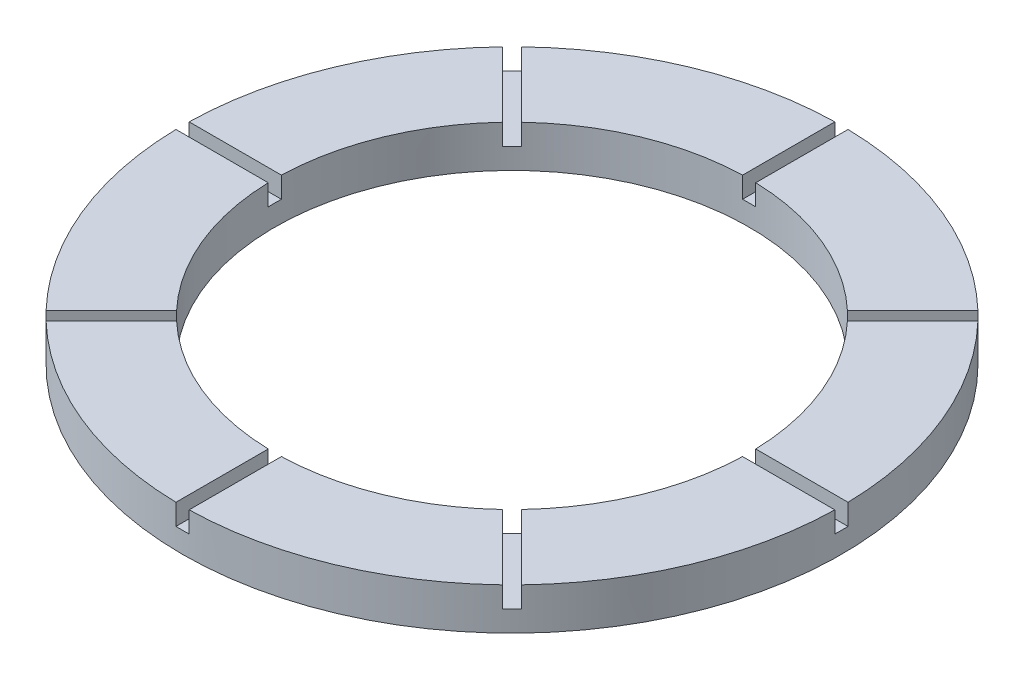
ISO-10303-21;
HEADER;
FILE_DESCRIPTION(('STEP AP214'),'2;1');
FILE_NAME('part.step','',(''),(''),'','','');
FILE_SCHEMA(('AUTOMOTIVE_DESIGN { 1 0 10303 214 1 1 1 1 }'));
ENDSEC;
DATA;
#1=APPLICATION_CONTEXT('core data for automotive mechanical design processes');
#2=APPLICATION_PROTOCOL_DEFINITION('international standard','automotive_design',2000,#1);
#3=PRODUCT_CONTEXT('',#1,'mechanical');
#4=PRODUCT('Part','Part','',(#3));
#5=PRODUCT_RELATED_PRODUCT_CATEGORY('part','',(#4));
#6=PRODUCT_DEFINITION_FORMATION('','',#4);
#7=PRODUCT_DEFINITION_CONTEXT('part definition',#1,'design');
#8=PRODUCT_DEFINITION('design','',#6,#7);
#9=PRODUCT_DEFINITION_SHAPE('','',#8);
#10=(LENGTH_UNIT() NAMED_UNIT(*) SI_UNIT(.MILLI.,.METRE.));
#11=(NAMED_UNIT(*) PLANE_ANGLE_UNIT() SI_UNIT($,.RADIAN.));
#12=(NAMED_UNIT(*) SI_UNIT($,.STERADIAN.) SOLID_ANGLE_UNIT());
#13=UNCERTAINTY_MEASURE_WITH_UNIT(LENGTH_MEASURE(1.E-05),#10,'distance_accuracy_value','');
#14=(GEOMETRIC_REPRESENTATION_CONTEXT(3) GLOBAL_UNCERTAINTY_ASSIGNED_CONTEXT((#13)) GLOBAL_UNIT_ASSIGNED_CONTEXT((#10,
#11,#12)) REPRESENTATION_CONTEXT('',''));
#15=CARTESIAN_POINT('',(0.,0.,0.));
#16=DIRECTION('',(0.,0.,1.));
#17=DIRECTION('',(1.,0.,0.));
#18=AXIS2_PLACEMENT_3D('',#15,#16,#17);
#19=CARTESIAN_POINT('',(0.,3.175,0.));
#20=DIRECTION('',(0.,1.,0.));
#21=DIRECTION('',(0.,0.,1.));
#22=AXIS2_PLACEMENT_3D('',#19,#20,#21);
#23=PLANE('',#22);
#24=CARTESIAN_POINT('',(0.,3.175,0.));
#25=DIRECTION('',(0.,1.,0.));
#26=DIRECTION('',(0.,0.,1.));
#27=AXIS2_PLACEMENT_3D('',#24,#25,#26);
#28=CIRCLE('',#27,36.);
#29=CARTESIAN_POINT('',(-1.,3.175,-35.9861084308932));
#30=VERTEX_POINT('',#29);
#31=CARTESIAN_POINT('',(-24.7389145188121,3.175,-26.1531280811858));
#32=VERTEX_POINT('',#31);
#33=EDGE_CURVE('E473',#30,#32,#28,.T.);
#34=ORIENTED_EDGE('',*,*,#33,.F.);
#35=DIRECTION('',(0.,0.,-1.));
#36=VECTOR('',#35,1.);
#37=CARTESIAN_POINT('',(-1.,3.175,0.));
#38=LINE('',#37,#36);
#39=CARTESIAN_POINT('',(-1.,3.175,-49.9899989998));
#40=VERTEX_POINT('',#39);
#41=EDGE_CURVE('E385',#30,#40,#38,.T.);
#42=ORIENTED_EDGE('',*,*,#41,.T.);
#43=CARTESIAN_POINT('',(0.,3.175,0.));
#44=DIRECTION('',(0.,1.,0.));
#45=DIRECTION('',(0.,0.,1.));
#46=AXIS2_PLACEMENT_3D('',#43,#44,#45);
#47=CIRCLE('',#46,50.);
#48=CARTESIAN_POINT('',(-34.6411605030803,3.175,-36.0553740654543));
#49=VERTEX_POINT('',#48);
#50=EDGE_CURVE('E471',#40,#49,#47,.T.);
#51=ORIENTED_EDGE('',*,*,#50,.T.);
#52=DIRECTION('',(-0.707106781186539,0.,-0.707106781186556));
#53=VECTOR('',#52,1.);
#54=CARTESIAN_POINT('',(0.707106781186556,3.175,-0.707106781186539));
#55=LINE('',#54,#53);
#56=EDGE_CURVE('E371',#32,#49,#55,.T.);
#57=ORIENTED_EDGE('',*,*,#56,.F.);
#58=EDGE_LOOP('',(#34,#42,#51,#57));
#59=FACE_BOUND('',#58,.T.);
#60=ADVANCED_FACE('F34',(#59),#23,.T.);
#61=CARTESIAN_POINT('',(0.999999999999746,3.175,35.9861084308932));
#62=VERTEX_POINT('',#61);
#63=CARTESIAN_POINT('',(24.7389145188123,3.175,26.1531280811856));
#64=VERTEX_POINT('',#63);
#65=EDGE_CURVE('E453',#62,#64,#28,.T.);
#66=ORIENTED_EDGE('',*,*,#65,.F.);
#67=DIRECTION('',(0.,0.,1.));
#68=VECTOR('',#67,1.);
#69=CARTESIAN_POINT('',(1.,3.175,0.));
#70=LINE('',#69,#68);
#71=CARTESIAN_POINT('',(0.999999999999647,3.175,49.9899989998));
#72=VERTEX_POINT('',#71);
#73=EDGE_CURVE('E345',#62,#72,#70,.T.);
#74=ORIENTED_EDGE('',*,*,#73,.T.);
#75=CARTESIAN_POINT('',(34.6411605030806,3.175,36.055374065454));
#76=VERTEX_POINT('',#75);
#77=EDGE_CURVE('E448',#72,#76,#47,.T.);
#78=ORIENTED_EDGE('',*,*,#77,.T.);
#79=DIRECTION('',(0.707106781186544,0.,0.707106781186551));
#80=VECTOR('',#79,1.);
#81=CARTESIAN_POINT('',(-0.707106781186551,3.175,0.707106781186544));
#82=LINE('',#81,#80);
#83=EDGE_CURVE('E331',#64,#76,#82,.T.);
#84=ORIENTED_EDGE('',*,*,#83,.F.);
#85=EDGE_LOOP('',(#66,#74,#78,#84));
#86=FACE_BOUND('',#85,.T.);
#87=ADVANCED_FACE('F550',(#86),#23,.T.);
#88=DIRECTION('',(0.,0.,1.));
#89=VECTOR('',#88,1.);
#90=CARTESIAN_POINT('',(-1.,3.175,0.));
#91=LINE('',#90,#89);
#92=CARTESIAN_POINT('',(-1.00000000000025,3.175,35.9861084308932));
#93=VERTEX_POINT('',#92);
#94=CARTESIAN_POINT('',(-1.00000000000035,3.175,49.9899989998));
#95=VERTEX_POINT('',#94);
#96=EDGE_CURVE('E342',#93,#95,#91,.T.);
#97=ORIENTED_EDGE('',*,*,#96,.F.);
#98=CARTESIAN_POINT('',(-24.7389145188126,3.175,26.1531280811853));
#99=VERTEX_POINT('',#98);
#100=EDGE_CURVE('E460',#99,#93,#28,.T.);
#101=ORIENTED_EDGE('',*,*,#100,.F.);
#102=DIRECTION('',(-0.707106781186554,0.,0.707106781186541));
#103=VECTOR('',#102,1.);
#104=CARTESIAN_POINT('',(0.707106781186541,3.175,0.707106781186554));
#105=LINE('',#104,#103);
#106=CARTESIAN_POINT('',(-34.6411605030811,3.175,36.0553740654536));
#107=VERTEX_POINT('',#106);
#108=EDGE_CURVE('E352',#99,#107,#105,.T.);
#109=ORIENTED_EDGE('',*,*,#108,.T.);
#110=EDGE_CURVE('E452',#107,#95,#47,.T.);
#111=ORIENTED_EDGE('',*,*,#110,.T.);
#112=EDGE_LOOP('',(#97,#101,#109,#111));
#113=FACE_BOUND('',#112,.T.);
#114=ADVANCED_FACE('F491',(#113),#23,.T.);
#115=CARTESIAN_POINT('',(26.1531280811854,3.175,24.7389145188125));
#116=VERTEX_POINT('',#115);
#117=CARTESIAN_POINT('',(35.9861084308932,3.175,1.00000000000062));
#118=VERTEX_POINT('',#117);
#119=EDGE_CURVE('E463',#116,#118,#28,.T.);
#120=ORIENTED_EDGE('',*,*,#119,.F.);
#121=DIRECTION('',(0.707106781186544,0.,0.707106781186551));
#122=VECTOR('',#121,1.);
#123=CARTESIAN_POINT('',(0.707106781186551,3.175,-0.707106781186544));
#124=LINE('',#123,#122);
#125=CARTESIAN_POINT('',(36.0553740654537,3.175,34.6411605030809));
#126=VERTEX_POINT('',#125);
#127=EDGE_CURVE('E334',#116,#126,#124,.T.);
#128=ORIENTED_EDGE('',*,*,#127,.T.);
#129=CARTESIAN_POINT('',(49.9899989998,3.175,1.00000000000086));
#130=VERTEX_POINT('',#129);
#131=EDGE_CURVE('E456',#126,#130,#47,.T.);
#132=ORIENTED_EDGE('',*,*,#131,.T.);
#133=DIRECTION('',(1.,0.,0.));
#134=VECTOR('',#133,1.);
#135=CARTESIAN_POINT('',(0.,3.175,1.));
#136=LINE('',#135,#134);
#137=EDGE_CURVE('E321',#118,#130,#136,.T.);
#138=ORIENTED_EDGE('',*,*,#137,.F.);
#139=EDGE_LOOP('',(#120,#128,#132,#138));
#140=FACE_BOUND('',#139,.T.);
#141=ADVANCED_FACE('F524',(#140),#23,.T.);
#142=DIRECTION('',(-0.707106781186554,0.,0.707106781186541));
#143=VECTOR('',#142,1.);
#144=CARTESIAN_POINT('',(-0.707106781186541,3.175,-0.707106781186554));
#145=LINE('',#144,#143);
#146=CARTESIAN_POINT('',(-26.1531280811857,3.175,24.7389145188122));
#147=VERTEX_POINT('',#146);
#148=CARTESIAN_POINT('',(-36.0553740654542,3.175,34.6411605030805));
#149=VERTEX_POINT('',#148);
#150=EDGE_CURVE('E350',#147,#149,#145,.T.);
#151=ORIENTED_EDGE('',*,*,#150,.F.);
#152=CARTESIAN_POINT('',(-35.9861084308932,3.175,0.999999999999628));
#153=VERTEX_POINT('',#152);
#154=EDGE_CURVE('E505',#153,#147,#28,.T.);
#155=ORIENTED_EDGE('',*,*,#154,.F.);
#156=DIRECTION('',(-1.,0.,0.));
#157=VECTOR('',#156,1.);
#158=CARTESIAN_POINT('',(0.,3.175,1.));
#159=LINE('',#158,#157);
#160=CARTESIAN_POINT('',(-49.9899989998,3.175,0.999999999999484));
#161=VERTEX_POINT('',#160);
#162=EDGE_CURVE('E363',#153,#161,#159,.T.);
#163=ORIENTED_EDGE('',*,*,#162,.T.);
#164=EDGE_CURVE('E479',#161,#149,#47,.T.);
#165=ORIENTED_EDGE('',*,*,#164,.T.);
#166=EDGE_LOOP('',(#151,#155,#163,#165));
#167=FACE_BOUND('',#166,.T.);
#168=ADVANCED_FACE('F541',(#167),#23,.T.);
#169=CARTESIAN_POINT('',(35.9861084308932,3.175,-0.99999999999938));
#170=VERTEX_POINT('',#169);
#171=CARTESIAN_POINT('',(26.1531280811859,3.175,-24.738914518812));
#172=VERTEX_POINT('',#171);
#173=EDGE_CURVE('E514',#170,#172,#28,.T.);
#174=ORIENTED_EDGE('',*,*,#173,.F.);
#175=DIRECTION('',(1.,0.,0.));
#176=VECTOR('',#175,1.);
#177=CARTESIAN_POINT('',(0.,3.175,-1.));
#178=LINE('',#177,#176);
#179=CARTESIAN_POINT('',(49.9899989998,3.175,-0.999999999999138));
#180=VERTEX_POINT('',#179);
#181=EDGE_CURVE('E323',#170,#180,#178,.T.);
#182=ORIENTED_EDGE('',*,*,#181,.T.);
#183=CARTESIAN_POINT('',(36.0553740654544,3.175,-34.6411605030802));
#184=VERTEX_POINT('',#183);
#185=EDGE_CURVE('E477',#180,#184,#47,.T.);
#186=ORIENTED_EDGE('',*,*,#185,.T.);
#187=DIRECTION('',(0.707106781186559,0.,-0.707106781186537));
#188=VECTOR('',#187,1.);
#189=CARTESIAN_POINT('',(0.707106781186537,3.175,0.707106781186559));
#190=LINE('',#189,#188);
#191=EDGE_CURVE('E248',#172,#184,#190,.T.);
#192=ORIENTED_EDGE('',*,*,#191,.F.);
#193=EDGE_LOOP('',(#174,#182,#186,#192));
#194=FACE_BOUND('',#193,.T.);
#195=ADVANCED_FACE('F538',(#194),#23,.T.);
#196=DIRECTION('',(-1.,0.,0.));
#197=VECTOR('',#196,1.);
#198=CARTESIAN_POINT('',(0.,3.175,-1.));
#199=LINE('',#198,#197);
#200=CARTESIAN_POINT('',(-35.9861084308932,3.175,-1.00000000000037));
#201=VERTEX_POINT('',#200);
#202=CARTESIAN_POINT('',(-49.9899989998,3.175,-1.00000000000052));
#203=VERTEX_POINT('',#202);
#204=EDGE_CURVE('E360',#201,#203,#199,.T.);
#205=ORIENTED_EDGE('',*,*,#204,.F.);
#206=CARTESIAN_POINT('',(-26.1531280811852,3.175,-24.7389145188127));
#207=VERTEX_POINT('',#206);
#208=EDGE_CURVE('E507',#207,#201,#28,.T.);
#209=ORIENTED_EDGE('',*,*,#208,.F.);
#210=DIRECTION('',(-0.707106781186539,0.,-0.707106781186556));
#211=VECTOR('',#210,1.);
#212=CARTESIAN_POINT('',(-0.707106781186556,3.175,0.707106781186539));
#213=LINE('',#212,#211);
#214=CARTESIAN_POINT('',(-36.0553740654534,3.175,-34.6411605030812));
#215=VERTEX_POINT('',#214);
#216=EDGE_CURVE('E374',#207,#215,#213,.T.);
#217=ORIENTED_EDGE('',*,*,#216,.T.);
#218=EDGE_CURVE('E475',#215,#203,#47,.T.);
#219=ORIENTED_EDGE('',*,*,#218,.T.);
#220=EDGE_LOOP('',(#205,#209,#217,#219));
#221=FACE_BOUND('',#220,.T.);
#222=ADVANCED_FACE('F540',(#221),#23,.T.);
#223=DIRECTION('',(0.,0.,-1.));
#224=VECTOR('',#223,1.);
#225=CARTESIAN_POINT('',(1.,3.175,0.));
#226=LINE('',#225,#224);
#227=CARTESIAN_POINT('',(1.,3.175,-35.9861084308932));
#228=VERTEX_POINT('',#227);
#229=CARTESIAN_POINT('',(1.,3.175,-49.9899989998));
#230=VERTEX_POINT('',#229);
#231=EDGE_CURVE('E382',#228,#230,#226,.T.);
#232=ORIENTED_EDGE('',*,*,#231,.F.);
#233=CARTESIAN_POINT('',(24.7389145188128,3.175,-26.1531280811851));
#234=VERTEX_POINT('',#233);
#235=EDGE_CURVE('E405',#234,#228,#28,.T.);
#236=ORIENTED_EDGE('',*,*,#235,.F.);
#237=DIRECTION('',(0.707106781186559,0.,-0.707106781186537));
#238=VECTOR('',#237,1.);
#239=CARTESIAN_POINT('',(-0.707106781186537,3.175,-0.707106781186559));
#240=LINE('',#239,#238);
#241=CARTESIAN_POINT('',(34.6411605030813,3.175,-36.0553740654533));
#242=VERTEX_POINT('',#241);
#243=EDGE_CURVE('E264',#234,#242,#240,.T.);
#244=ORIENTED_EDGE('',*,*,#243,.T.);
#245=EDGE_CURVE('E474',#242,#230,#47,.T.);
#246=ORIENTED_EDGE('',*,*,#245,.T.);
#247=EDGE_LOOP('',(#232,#236,#244,#246));
#248=FACE_BOUND('',#247,.T.);
#249=ADVANCED_FACE('F547',(#248),#23,.T.);
#250=CARTESIAN_POINT('',(0.,3.175,0.));
#251=DIRECTION('',(0.,-1.,0.));
#252=DIRECTION('',(0.,0.,-1.));
#253=AXIS2_PLACEMENT_3D('',#250,#251,#252);
#254=CYLINDRICAL_SURFACE('',#253,50.);
#255=CARTESIAN_POINT('',(0.,-3.175,0.));
#256=DIRECTION('',(0.,1.,0.));
#257=DIRECTION('',(0.,0.,1.));
#258=AXIS2_PLACEMENT_3D('',#255,#256,#257);
#259=CIRCLE('',#258,50.);
#260=CARTESIAN_POINT('',(0.,-3.175,50.));
#261=VERTEX_POINT('',#260);
#262=EDGE_CURVE('E449',#261,#261,#259,.T.);
#263=ORIENTED_EDGE('',*,*,#262,.T.);
#264=EDGE_LOOP('',(#263));
#265=FACE_BOUND('',#264,.T.);
#266=DIRECTION('',(0.,-1.,0.));
#267=VECTOR('',#266,1.);
#268=CARTESIAN_POINT('',(-1.,3.175,-49.9899989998));
#269=LINE('',#268,#267);
#270=CARTESIAN_POINT('',(-1.,0.,-49.9899989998));
#271=VERTEX_POINT('',#270);
#272=EDGE_CURVE('E274',#271,#40,#269,.F.);
#273=ORIENTED_EDGE('',*,*,#272,.F.);
#274=CARTESIAN_POINT('',(0.,0.,0.));
#275=DIRECTION('',(0.,-1.,0.));
#276=DIRECTION('',(0.,0.,-1.));
#277=AXIS2_PLACEMENT_3D('',#274,#275,#276);
#278=CIRCLE('',#277,50.);
#279=CARTESIAN_POINT('',(1.,0.,-49.9899989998));
#280=VERTEX_POINT('',#279);
#281=EDGE_CURVE('E272',#271,#280,#278,.T.);
#282=ORIENTED_EDGE('',*,*,#281,.T.);
#283=DIRECTION('',(0.,-1.,0.));
#284=VECTOR('',#283,1.);
#285=CARTESIAN_POINT('',(1.,3.175,-49.9899989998));
#286=LINE('',#285,#284);
#287=EDGE_CURVE('E269',#280,#230,#286,.F.);
#288=ORIENTED_EDGE('',*,*,#287,.T.);
#289=ORIENTED_EDGE('',*,*,#245,.F.);
#290=DIRECTION('',(0.,-1.,0.));
#291=VECTOR('',#290,1.);
#292=CARTESIAN_POINT('',(34.6411605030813,3.175,-36.0553740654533));
#293=LINE('',#292,#291);
#294=CARTESIAN_POINT('',(34.6411605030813,0.,-36.0553740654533));
#295=VERTEX_POINT('',#294);
#296=EDGE_CURVE('E253',#295,#242,#293,.F.);
#297=ORIENTED_EDGE('',*,*,#296,.F.);
#298=CARTESIAN_POINT('',(36.0553740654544,0.,-34.6411605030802));
#299=VERTEX_POINT('',#298);
#300=EDGE_CURVE('E258',#295,#299,#278,.T.);
#301=ORIENTED_EDGE('',*,*,#300,.T.);
#302=DIRECTION('',(0.,-1.,0.));
#303=VECTOR('',#302,1.);
#304=CARTESIAN_POINT('',(36.0553740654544,3.175,-34.6411605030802));
#305=LINE('',#304,#303);
#306=EDGE_CURVE('E242',#299,#184,#305,.F.);
#307=ORIENTED_EDGE('',*,*,#306,.T.);
#308=ORIENTED_EDGE('',*,*,#185,.F.);
#309=DIRECTION('',(0.,-1.,0.));
#310=VECTOR('',#309,1.);
#311=CARTESIAN_POINT('',(49.9899989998,3.175,-0.999999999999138));
#312=LINE('',#311,#310);
#313=CARTESIAN_POINT('',(49.9899989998,0.,-0.999999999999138));
#314=VERTEX_POINT('',#313);
#315=EDGE_CURVE('E304',#314,#180,#312,.F.);
#316=ORIENTED_EDGE('',*,*,#315,.F.);
#317=CARTESIAN_POINT('',(49.9899989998,0.,1.00000000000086));
#318=VERTEX_POINT('',#317);
#319=EDGE_CURVE('E270',#314,#318,#278,.T.);
#320=ORIENTED_EDGE('',*,*,#319,.T.);
#321=DIRECTION('',(0.,-1.,0.));
#322=VECTOR('',#321,1.);
#323=CARTESIAN_POINT('',(49.9899989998,3.175,1.00000000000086));
#324=LINE('',#323,#322);
#325=EDGE_CURVE('E306',#318,#130,#324,.F.);
#326=ORIENTED_EDGE('',*,*,#325,.T.);
#327=ORIENTED_EDGE('',*,*,#131,.F.);
#328=DIRECTION('',(0.,-1.,0.));
#329=VECTOR('',#328,1.);
#330=CARTESIAN_POINT('',(36.0553740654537,3.175,34.6411605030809));
#331=LINE('',#330,#329);
#332=CARTESIAN_POINT('',(36.0553740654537,0.,34.6411605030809));
#333=VERTEX_POINT('',#332);
#334=EDGE_CURVE('E297',#333,#126,#331,.F.);
#335=ORIENTED_EDGE('',*,*,#334,.F.);
#336=CARTESIAN_POINT('',(34.6411605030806,0.,36.055374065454));
#337=VERTEX_POINT('',#336);
#338=EDGE_CURVE('E277',#333,#337,#278,.T.);
#339=ORIENTED_EDGE('',*,*,#338,.T.);
#340=DIRECTION('',(0.,-1.,0.));
#341=VECTOR('',#340,1.);
#342=CARTESIAN_POINT('',(34.6411605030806,3.175,36.055374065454));
#343=LINE('',#342,#341);
#344=EDGE_CURVE('E299',#337,#76,#343,.F.);
#345=ORIENTED_EDGE('',*,*,#344,.T.);
#346=ORIENTED_EDGE('',*,*,#77,.F.);
#347=DIRECTION('',(0.,-1.,0.));
#348=VECTOR('',#347,1.);
#349=CARTESIAN_POINT('',(0.999999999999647,3.175,49.9899989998));
#350=LINE('',#349,#348);
#351=CARTESIAN_POINT('',(0.999999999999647,0.,49.9899989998));
#352=VERTEX_POINT('',#351);
#353=EDGE_CURVE('E281',#352,#72,#350,.F.);
#354=ORIENTED_EDGE('',*,*,#353,.F.);
#355=CARTESIAN_POINT('',(-1.00000000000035,0.,49.9899989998));
#356=VERTEX_POINT('',#355);
#357=EDGE_CURVE('E497',#352,#356,#278,.T.);
#358=ORIENTED_EDGE('',*,*,#357,.T.);
#359=DIRECTION('',(0.,-1.,0.));
#360=VECTOR('',#359,1.);
#361=CARTESIAN_POINT('',(-1.00000000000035,3.175,49.9899989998));
#362=LINE('',#361,#360);
#363=EDGE_CURVE('E284',#356,#95,#362,.F.);
#364=ORIENTED_EDGE('',*,*,#363,.T.);
#365=ORIENTED_EDGE('',*,*,#110,.F.);
#366=DIRECTION('',(0.,-1.,0.));
#367=VECTOR('',#366,1.);
#368=CARTESIAN_POINT('',(-34.6411605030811,3.175,36.0553740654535));
#369=LINE('',#368,#367);
#370=CARTESIAN_POINT('',(-34.6411605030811,0.,36.0553740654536));
#371=VERTEX_POINT('',#370);
#372=EDGE_CURVE('E290',#371,#107,#369,.F.);
#373=ORIENTED_EDGE('',*,*,#372,.F.);
#374=CARTESIAN_POINT('',(-36.0553740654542,0.,34.6411605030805));
#375=VERTEX_POINT('',#374);
#376=EDGE_CURVE('E845',#371,#375,#278,.T.);
#377=ORIENTED_EDGE('',*,*,#376,.T.);
#378=DIRECTION('',(0.,-1.,0.));
#379=VECTOR('',#378,1.);
#380=CARTESIAN_POINT('',(-36.0553740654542,3.175,34.6411605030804));
#381=LINE('',#380,#379);
#382=EDGE_CURVE('E294',#375,#149,#381,.F.);
#383=ORIENTED_EDGE('',*,*,#382,.T.);
#384=ORIENTED_EDGE('',*,*,#164,.F.);
#385=DIRECTION('',(0.,-1.,0.));
#386=VECTOR('',#385,1.);
#387=CARTESIAN_POINT('',(-49.9899989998,3.175,0.999999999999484));
#388=LINE('',#387,#386);
#389=CARTESIAN_POINT('',(-49.9899989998,0.,0.999999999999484));
#390=VERTEX_POINT('',#389);
#391=EDGE_CURVE('E302',#390,#161,#388,.F.);
#392=ORIENTED_EDGE('',*,*,#391,.F.);
#393=CARTESIAN_POINT('',(-49.9899989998,0.,-1.00000000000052));
#394=VERTEX_POINT('',#393);
#395=EDGE_CURVE('E283',#390,#394,#278,.T.);
#396=ORIENTED_EDGE('',*,*,#395,.T.);
#397=DIRECTION('',(0.,-1.,0.));
#398=VECTOR('',#397,1.);
#399=CARTESIAN_POINT('',(-49.9899989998,3.175,-1.00000000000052));
#400=LINE('',#399,#398);
#401=EDGE_CURVE('E309',#394,#203,#400,.F.);
#402=ORIENTED_EDGE('',*,*,#401,.T.);
#403=ORIENTED_EDGE('',*,*,#218,.F.);
#404=DIRECTION('',(0.,-1.,0.));
#405=VECTOR('',#404,1.);
#406=CARTESIAN_POINT('',(-36.0553740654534,3.175,-34.6411605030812));
#407=LINE('',#406,#405);
#408=CARTESIAN_POINT('',(-36.0553740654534,0.,-34.6411605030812));
#409=VERTEX_POINT('',#408);
#410=EDGE_CURVE('E312',#409,#215,#407,.F.);
#411=ORIENTED_EDGE('',*,*,#410,.F.);
#412=CARTESIAN_POINT('',(-34.6411605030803,0.,-36.0553740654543));
#413=VERTEX_POINT('',#412);
#414=EDGE_CURVE('E280',#409,#413,#278,.T.);
#415=ORIENTED_EDGE('',*,*,#414,.T.);
#416=DIRECTION('',(0.,-1.,0.));
#417=VECTOR('',#416,1.);
#418=CARTESIAN_POINT('',(-34.6411605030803,3.175,-36.0553740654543));
#419=LINE('',#418,#417);
#420=EDGE_CURVE('E314',#413,#49,#419,.F.);
#421=ORIENTED_EDGE('',*,*,#420,.T.);
#422=ORIENTED_EDGE('',*,*,#50,.F.);
#423=EDGE_LOOP('',(#273,#282,#288,#289,#297,#301,#307,#308,#316,#320,#326,#327,#335,#339,#345,
#346,#354,#358,#364,#365,#373,#377,#383,#384,#392,#396,#402,#403,#411,#415,#421,#422));
#424=FACE_BOUND('',#423,.T.);
#425=ADVANCED_FACE('F36',(#265,#424),#254,.T.);
#426=CARTESIAN_POINT('',(0.,3.175,0.));
#427=DIRECTION('',(0.,-1.,0.));
#428=DIRECTION('',(0.,0.,-1.));
#429=AXIS2_PLACEMENT_3D('',#426,#427,#428);
#430=CYLINDRICAL_SURFACE('',#429,36.);
#431=CARTESIAN_POINT('',(0.,-3.175,0.));
#432=DIRECTION('',(0.,1.,0.));
#433=DIRECTION('',(0.,0.,1.));
#434=AXIS2_PLACEMENT_3D('',#431,#432,#433);
#435=CIRCLE('',#434,36.);
#436=CARTESIAN_POINT('',(0.,-3.175,36.));
#437=VERTEX_POINT('',#436);
#438=EDGE_CURVE('E457',#437,#437,#435,.T.);
#439=ORIENTED_EDGE('',*,*,#438,.F.);
#440=EDGE_LOOP('',(#439));
#441=FACE_BOUND('',#440,.T.);
#442=CARTESIAN_POINT('',(0.,0.,0.));
#443=DIRECTION('',(0.,-1.,0.));
#444=DIRECTION('',(0.,0.,-1.));
#445=AXIS2_PLACEMENT_3D('',#442,#443,#444);
#446=CIRCLE('',#445,36.);
#447=CARTESIAN_POINT('',(-1.,0.,-35.9861084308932));
#448=VERTEX_POINT('',#447);
#449=CARTESIAN_POINT('',(1.,0.,-35.9861084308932));
#450=VERTEX_POINT('',#449);
#451=EDGE_CURVE('E395',#448,#450,#446,.T.);
#452=ORIENTED_EDGE('',*,*,#451,.F.);
#453=DIRECTION('',(0.,-1.,0.));
#454=VECTOR('',#453,1.);
#455=CARTESIAN_POINT('',(-1.,3.175,-35.9861084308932));
#456=LINE('',#455,#454);
#457=EDGE_CURVE('E11',#448,#30,#456,.F.);
#458=ORIENTED_EDGE('',*,*,#457,.T.);
#459=ORIENTED_EDGE('',*,*,#33,.T.);
#460=DIRECTION('',(0.,-1.,0.));
#461=VECTOR('',#460,1.);
#462=CARTESIAN_POINT('',(-24.7389145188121,3.175,-26.1531280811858));
#463=LINE('',#462,#461);
#464=CARTESIAN_POINT('',(-24.7389145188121,0.,-26.1531280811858));
#465=VERTEX_POINT('',#464);
#466=EDGE_CURVE('E442',#465,#32,#463,.F.);
#467=ORIENTED_EDGE('',*,*,#466,.F.);
#468=CARTESIAN_POINT('',(-26.1531280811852,0.,-24.7389145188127));
#469=VERTEX_POINT('',#468);
#470=EDGE_CURVE('E441',#469,#465,#446,.T.);
#471=ORIENTED_EDGE('',*,*,#470,.F.);
#472=DIRECTION('',(0.,-1.,0.));
#473=VECTOR('',#472,1.);
#474=CARTESIAN_POINT('',(-26.1531280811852,3.175,-24.7389145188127));
#475=LINE('',#474,#473);
#476=EDGE_CURVE('E438',#469,#207,#475,.F.);
#477=ORIENTED_EDGE('',*,*,#476,.T.);
#478=ORIENTED_EDGE('',*,*,#208,.T.);
#479=DIRECTION('',(0.,-1.,0.));
#480=VECTOR('',#479,1.);
#481=CARTESIAN_POINT('',(-35.9861084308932,3.175,-1.00000000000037));
#482=LINE('',#481,#480);
#483=CARTESIAN_POINT('',(-35.9861084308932,0.,-1.00000000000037));
#484=VERTEX_POINT('',#483);
#485=EDGE_CURVE('E436',#484,#201,#482,.F.);
#486=ORIENTED_EDGE('',*,*,#485,.F.);
#487=CARTESIAN_POINT('',(-35.9861084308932,0.,0.999999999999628));
#488=VERTEX_POINT('',#487);
#489=EDGE_CURVE('E435',#488,#484,#446,.T.);
#490=ORIENTED_EDGE('',*,*,#489,.F.);
#491=DIRECTION('',(0.,-1.,0.));
#492=VECTOR('',#491,1.);
#493=CARTESIAN_POINT('',(-35.9861084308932,3.175,0.999999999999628));
#494=LINE('',#493,#492);
#495=EDGE_CURVE('E432',#488,#153,#494,.F.);
#496=ORIENTED_EDGE('',*,*,#495,.T.);
#497=ORIENTED_EDGE('',*,*,#154,.T.);
#498=DIRECTION('',(0.,-1.,0.));
#499=VECTOR('',#498,1.);
#500=CARTESIAN_POINT('',(-26.1531280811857,3.175,24.7389145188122));
#501=LINE('',#500,#499);
#502=CARTESIAN_POINT('',(-26.1531280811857,0.,24.7389145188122));
#503=VERTEX_POINT('',#502);
#504=EDGE_CURVE('E418',#503,#147,#501,.F.);
#505=ORIENTED_EDGE('',*,*,#504,.F.);
#506=CARTESIAN_POINT('',(-24.7389145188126,0.,26.1531280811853));
#507=VERTEX_POINT('',#506);
#508=EDGE_CURVE('E417',#507,#503,#446,.T.);
#509=ORIENTED_EDGE('',*,*,#508,.F.);
#510=DIRECTION('',(0.,-1.,0.));
#511=VECTOR('',#510,1.);
#512=CARTESIAN_POINT('',(-24.7389145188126,3.175,26.1531280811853));
#513=LINE('',#512,#511);
#514=EDGE_CURVE('E414',#507,#99,#513,.F.);
#515=ORIENTED_EDGE('',*,*,#514,.T.);
#516=ORIENTED_EDGE('',*,*,#100,.T.);
#517=DIRECTION('',(0.,-1.,0.));
#518=VECTOR('',#517,1.);
#519=CARTESIAN_POINT('',(-1.00000000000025,3.175,35.9861084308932));
#520=LINE('',#519,#518);
#521=CARTESIAN_POINT('',(-1.00000000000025,0.,35.9861084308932));
#522=VERTEX_POINT('',#521);
#523=EDGE_CURVE('E412',#522,#93,#520,.F.);
#524=ORIENTED_EDGE('',*,*,#523,.F.);
#525=CARTESIAN_POINT('',(0.999999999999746,0.,35.9861084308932));
#526=VERTEX_POINT('',#525);
#527=EDGE_CURVE('E408',#526,#522,#446,.T.);
#528=ORIENTED_EDGE('',*,*,#527,.F.);
#529=DIRECTION('',(0.,-1.,0.));
#530=VECTOR('',#529,1.);
#531=CARTESIAN_POINT('',(0.999999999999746,3.175,35.9861084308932));
#532=LINE('',#531,#530);
#533=EDGE_CURVE('E406',#526,#62,#532,.F.);
#534=ORIENTED_EDGE('',*,*,#533,.T.);
#535=ORIENTED_EDGE('',*,*,#65,.T.);
#536=DIRECTION('',(0.,-1.,0.));
#537=VECTOR('',#536,1.);
#538=CARTESIAN_POINT('',(24.7389145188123,3.175,26.1531280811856));
#539=LINE('',#538,#537);
#540=CARTESIAN_POINT('',(24.7389145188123,0.,26.1531280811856));
#541=VERTEX_POINT('',#540);
#542=EDGE_CURVE('E424',#541,#64,#539,.F.);
#543=ORIENTED_EDGE('',*,*,#542,.F.);
#544=CARTESIAN_POINT('',(26.1531280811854,0.,24.7389145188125));
#545=VERTEX_POINT('',#544);
#546=EDGE_CURVE('E423',#545,#541,#446,.T.);
#547=ORIENTED_EDGE('',*,*,#546,.F.);
#548=DIRECTION('',(0.,-1.,0.));
#549=VECTOR('',#548,1.);
#550=CARTESIAN_POINT('',(26.1531280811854,3.175,24.7389145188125));
#551=LINE('',#550,#549);
#552=EDGE_CURVE('E420',#545,#116,#551,.F.);
#553=ORIENTED_EDGE('',*,*,#552,.T.);
#554=ORIENTED_EDGE('',*,*,#119,.T.);
#555=DIRECTION('',(0.,-1.,0.));
#556=VECTOR('',#555,1.);
#557=CARTESIAN_POINT('',(35.9861084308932,3.175,1.00000000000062));
#558=LINE('',#557,#556);
#559=CARTESIAN_POINT('',(35.9861084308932,0.,1.00000000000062));
#560=VERTEX_POINT('',#559);
#561=EDGE_CURVE('E430',#560,#118,#558,.F.);
#562=ORIENTED_EDGE('',*,*,#561,.F.);
#563=CARTESIAN_POINT('',(35.9861084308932,0.,-0.99999999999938));
#564=VERTEX_POINT('',#563);
#565=EDGE_CURVE('E429',#564,#560,#446,.T.);
#566=ORIENTED_EDGE('',*,*,#565,.F.);
#567=DIRECTION('',(0.,-1.,0.));
#568=VECTOR('',#567,1.);
#569=CARTESIAN_POINT('',(35.9861084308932,3.175,-0.99999999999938));
#570=LINE('',#569,#568);
#571=EDGE_CURVE('E426',#564,#170,#570,.F.);
#572=ORIENTED_EDGE('',*,*,#571,.T.);
#573=ORIENTED_EDGE('',*,*,#173,.T.);
#574=DIRECTION('',(0.,-1.,0.));
#575=VECTOR('',#574,1.);
#576=CARTESIAN_POINT('',(26.1531280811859,3.175,-24.738914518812));
#577=LINE('',#576,#575);
#578=CARTESIAN_POINT('',(26.1531280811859,0.,-24.738914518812));
#579=VERTEX_POINT('',#578);
#580=EDGE_CURVE('E446',#579,#172,#577,.F.);
#581=ORIENTED_EDGE('',*,*,#580,.F.);
#582=CARTESIAN_POINT('',(24.7389145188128,0.,-26.1531280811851));
#583=VERTEX_POINT('',#582);
#584=EDGE_CURVE('E261',#583,#579,#446,.T.);
#585=ORIENTED_EDGE('',*,*,#584,.F.);
#586=DIRECTION('',(0.,-1.,0.));
#587=VECTOR('',#586,1.);
#588=CARTESIAN_POINT('',(24.7389145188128,3.175,-26.1531280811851));
#589=LINE('',#588,#587);
#590=EDGE_CURVE('E444',#583,#234,#589,.F.);
#591=ORIENTED_EDGE('',*,*,#590,.T.);
#592=ORIENTED_EDGE('',*,*,#235,.T.);
#593=DIRECTION('',(0.,-1.,0.));
#594=VECTOR('',#593,1.);
#595=CARTESIAN_POINT('',(1.,3.175,-35.9861084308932));
#596=LINE('',#595,#594);
#597=EDGE_CURVE('E42',#450,#228,#596,.F.);
#598=ORIENTED_EDGE('',*,*,#597,.F.);
#599=EDGE_LOOP('',(#452,#458,#459,#467,#471,#477,#478,#486,#490,#496,#497,#505,#509,#515,#516,
#524,#528,#534,#535,#543,#547,#553,#554,#562,#566,#572,#573,#581,#585,#591,#592,#598));
#600=FACE_BOUND('',#599,.T.);
#601=ADVANCED_FACE('F402',(#441,#600),#430,.F.);
#602=CARTESIAN_POINT('',(0.,-3.175,0.));
#603=DIRECTION('',(0.,1.,0.));
#604=DIRECTION('',(0.,0.,1.));
#605=AXIS2_PLACEMENT_3D('',#602,#603,#604);
#606=PLANE('',#605);
#607=ORIENTED_EDGE('',*,*,#262,.F.);
#608=EDGE_LOOP('',(#607));
#609=FACE_BOUND('',#608,.T.);
#610=ORIENTED_EDGE('',*,*,#438,.T.);
#611=EDGE_LOOP('',(#610));
#612=FACE_BOUND('',#611,.T.);
#613=ADVANCED_FACE('F571',(#609,#612),#606,.F.);
#614=CARTESIAN_POINT('',(0.707106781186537,0.,0.707106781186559));
#615=DIRECTION('',(0.707106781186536,0.,0.707106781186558));
#616=DIRECTION('',(0.707106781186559,0.,-0.707106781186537));
#617=AXIS2_PLACEMENT_3D('',#614,#615,#616);
#618=PLANE('',#617);
#619=DIRECTION('',(0.707106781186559,0.,-0.707106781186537));
#620=VECTOR('',#619,1.);
#621=CARTESIAN_POINT('',(0.707106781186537,0.,0.707106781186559));
#622=LINE('',#621,#620);
#623=EDGE_CURVE('E245',#579,#299,#622,.T.);
#624=ORIENTED_EDGE('',*,*,#623,.F.);
#625=ORIENTED_EDGE('',*,*,#580,.T.);
#626=ORIENTED_EDGE('',*,*,#191,.T.);
#627=ORIENTED_EDGE('',*,*,#306,.F.);
#628=EDGE_LOOP('',(#624,#625,#626,#627));
#629=FACE_BOUND('',#628,.T.);
#630=ADVANCED_FACE('F244',(#629),#618,.F.);
#631=CARTESIAN_POINT('',(-0.707106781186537,0.,-0.707106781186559));
#632=DIRECTION('',(0.707106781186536,0.,0.707106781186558));
#633=DIRECTION('',(0.707106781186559,0.,-0.707106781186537));
#634=AXIS2_PLACEMENT_3D('',#631,#632,#633);
#635=PLANE('',#634);
#636=ORIENTED_EDGE('',*,*,#296,.T.);
#637=ORIENTED_EDGE('',*,*,#243,.F.);
#638=ORIENTED_EDGE('',*,*,#590,.F.);
#639=DIRECTION('',(0.707106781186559,0.,-0.707106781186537));
#640=VECTOR('',#639,1.);
#641=CARTESIAN_POINT('',(-0.707106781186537,0.,-0.707106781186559));
#642=LINE('',#641,#640);
#643=EDGE_CURVE('E263',#583,#295,#642,.T.);
#644=ORIENTED_EDGE('',*,*,#643,.T.);
#645=EDGE_LOOP('',(#636,#637,#638,#644));
#646=FACE_BOUND('',#645,.T.);
#647=ADVANCED_FACE('F562',(#646),#635,.T.);
#648=CARTESIAN_POINT('',(0.,0.,0.));
#649=DIRECTION('',(0.,-1.,0.));
#650=DIRECTION('',(-1.,0.,0.));
#651=AXIS2_PLACEMENT_3D('',#648,#649,#650);
#652=PLANE('',#651);
#653=ORIENTED_EDGE('',*,*,#643,.F.);
#654=ORIENTED_EDGE('',*,*,#584,.T.);
#655=ORIENTED_EDGE('',*,*,#623,.T.);
#656=ORIENTED_EDGE('',*,*,#300,.F.);
#657=EDGE_LOOP('',(#653,#654,#655,#656));
#658=FACE_BOUND('',#657,.T.);
#659=ADVANCED_FACE('F257',(#658),#652,.F.);
#660=CARTESIAN_POINT('',(0.707106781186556,0.,-0.707106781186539));
#661=DIRECTION('',(0.707106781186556,0.,-0.707106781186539));
#662=DIRECTION('',(-0.707106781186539,0.,-0.707106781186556));
#663=AXIS2_PLACEMENT_3D('',#660,#661,#662);
#664=PLANE('',#663);
#665=DIRECTION('',(-0.707106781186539,0.,-0.707106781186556));
#666=VECTOR('',#665,1.);
#667=CARTESIAN_POINT('',(0.707106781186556,0.,-0.707106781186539));
#668=LINE('',#667,#666);
#669=EDGE_CURVE('E377',#465,#413,#668,.T.);
#670=ORIENTED_EDGE('',*,*,#669,.F.);
#671=ORIENTED_EDGE('',*,*,#466,.T.);
#672=ORIENTED_EDGE('',*,*,#56,.T.);
#673=ORIENTED_EDGE('',*,*,#420,.F.);
#674=EDGE_LOOP('',(#670,#671,#672,#673));
#675=FACE_BOUND('',#674,.T.);
#676=ADVANCED_FACE('F569',(#675),#664,.F.);
#677=CARTESIAN_POINT('',(-0.707106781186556,0.,0.707106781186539));
#678=DIRECTION('',(0.707106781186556,0.,-0.707106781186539));
#679=DIRECTION('',(-0.707106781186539,0.,-0.707106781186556));
#680=AXIS2_PLACEMENT_3D('',#677,#678,#679);
#681=PLANE('',#680);
#682=ORIENTED_EDGE('',*,*,#410,.T.);
#683=ORIENTED_EDGE('',*,*,#216,.F.);
#684=ORIENTED_EDGE('',*,*,#476,.F.);
#685=DIRECTION('',(-0.707106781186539,0.,-0.707106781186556));
#686=VECTOR('',#685,1.);
#687=CARTESIAN_POINT('',(-0.707106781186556,0.,0.707106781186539));
#688=LINE('',#687,#686);
#689=EDGE_CURVE('E379',#469,#409,#688,.T.);
#690=ORIENTED_EDGE('',*,*,#689,.T.);
#691=EDGE_LOOP('',(#682,#683,#684,#690));
#692=FACE_BOUND('',#691,.T.);
#693=ADVANCED_FACE('F613',(#692),#681,.T.);
#694=ORIENTED_EDGE('',*,*,#689,.F.);
#695=ORIENTED_EDGE('',*,*,#470,.T.);
#696=ORIENTED_EDGE('',*,*,#669,.T.);
#697=ORIENTED_EDGE('',*,*,#414,.F.);
#698=EDGE_LOOP('',(#694,#695,#696,#697));
#699=FACE_BOUND('',#698,.T.);
#700=ADVANCED_FACE('F623',(#699),#652,.F.);
#701=CARTESIAN_POINT('',(0.,0.,-1.));
#702=DIRECTION('',(0.,0.,-1.));
#703=DIRECTION('',(-1.,0.,0.));
#704=AXIS2_PLACEMENT_3D('',#701,#702,#703);
#705=PLANE('',#704);
#706=DIRECTION('',(-1.,0.,0.));
#707=VECTOR('',#706,1.);
#708=CARTESIAN_POINT('',(0.,0.,-1.));
#709=LINE('',#708,#707);
#710=EDGE_CURVE('E366',#484,#394,#709,.T.);
#711=ORIENTED_EDGE('',*,*,#710,.F.);
#712=ORIENTED_EDGE('',*,*,#485,.T.);
#713=ORIENTED_EDGE('',*,*,#204,.T.);
#714=ORIENTED_EDGE('',*,*,#401,.F.);
#715=EDGE_LOOP('',(#711,#712,#713,#714));
#716=FACE_BOUND('',#715,.T.);
#717=ADVANCED_FACE('F634',(#716),#705,.F.);
#718=CARTESIAN_POINT('',(0.,0.,1.));
#719=DIRECTION('',(0.,0.,-1.));
#720=DIRECTION('',(-1.,0.,0.));
#721=AXIS2_PLACEMENT_3D('',#718,#719,#720);
#722=PLANE('',#721);
#723=ORIENTED_EDGE('',*,*,#391,.T.);
#724=ORIENTED_EDGE('',*,*,#162,.F.);
#725=ORIENTED_EDGE('',*,*,#495,.F.);
#726=DIRECTION('',(-1.,0.,0.));
#727=VECTOR('',#726,1.);
#728=CARTESIAN_POINT('',(0.,0.,1.));
#729=LINE('',#728,#727);
#730=EDGE_CURVE('E368',#488,#390,#729,.T.);
#731=ORIENTED_EDGE('',*,*,#730,.T.);
#732=EDGE_LOOP('',(#723,#724,#725,#731));
#733=FACE_BOUND('',#732,.T.);
#734=ADVANCED_FACE('F644',(#733),#722,.T.);
#735=ORIENTED_EDGE('',*,*,#730,.F.);
#736=ORIENTED_EDGE('',*,*,#489,.T.);
#737=ORIENTED_EDGE('',*,*,#710,.T.);
#738=ORIENTED_EDGE('',*,*,#395,.F.);
#739=EDGE_LOOP('',(#735,#736,#737,#738));
#740=FACE_BOUND('',#739,.T.);
#741=ADVANCED_FACE('F636',(#740),#652,.F.);
#742=CARTESIAN_POINT('',(0.,0.,1.));
#743=DIRECTION('',(0.,0.,1.));
#744=DIRECTION('',(1.,0.,0.));
#745=AXIS2_PLACEMENT_3D('',#742,#743,#744);
#746=PLANE('',#745);
#747=DIRECTION('',(1.,0.,0.));
#748=VECTOR('',#747,1.);
#749=CARTESIAN_POINT('',(0.,0.,1.));
#750=LINE('',#749,#748);
#751=EDGE_CURVE('E326',#560,#318,#750,.T.);
#752=ORIENTED_EDGE('',*,*,#751,.F.);
#753=ORIENTED_EDGE('',*,*,#561,.T.);
#754=ORIENTED_EDGE('',*,*,#137,.T.);
#755=ORIENTED_EDGE('',*,*,#325,.F.);
#756=EDGE_LOOP('',(#752,#753,#754,#755));
#757=FACE_BOUND('',#756,.T.);
#758=ADVANCED_FACE('F528',(#757),#746,.F.);
#759=CARTESIAN_POINT('',(0.,0.,-1.));
#760=DIRECTION('',(0.,0.,1.));
#761=DIRECTION('',(1.,0.,0.));
#762=AXIS2_PLACEMENT_3D('',#759,#760,#761);
#763=PLANE('',#762);
#764=ORIENTED_EDGE('',*,*,#315,.T.);
#765=ORIENTED_EDGE('',*,*,#181,.F.);
#766=ORIENTED_EDGE('',*,*,#571,.F.);
#767=DIRECTION('',(1.,0.,0.));
#768=VECTOR('',#767,1.);
#769=CARTESIAN_POINT('',(0.,0.,-1.));
#770=LINE('',#769,#768);
#771=EDGE_CURVE('E328',#564,#314,#770,.T.);
#772=ORIENTED_EDGE('',*,*,#771,.T.);
#773=EDGE_LOOP('',(#764,#765,#766,#772));
#774=FACE_BOUND('',#773,.T.);
#775=ADVANCED_FACE('F536',(#774),#763,.T.);
#776=ORIENTED_EDGE('',*,*,#771,.F.);
#777=ORIENTED_EDGE('',*,*,#565,.T.);
#778=ORIENTED_EDGE('',*,*,#751,.T.);
#779=ORIENTED_EDGE('',*,*,#319,.F.);
#780=EDGE_LOOP('',(#776,#777,#778,#779));
#781=FACE_BOUND('',#780,.T.);
#782=ADVANCED_FACE('F533',(#781),#652,.F.);
#783=CARTESIAN_POINT('',(-0.707106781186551,0.,0.707106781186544));
#784=DIRECTION('',(-0.707106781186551,0.,0.707106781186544));
#785=DIRECTION('',(0.707106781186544,0.,0.707106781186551));
#786=AXIS2_PLACEMENT_3D('',#783,#784,#785);
#787=PLANE('',#786);
#788=DIRECTION('',(0.707106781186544,0.,0.707106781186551));
#789=VECTOR('',#788,1.);
#790=CARTESIAN_POINT('',(-0.707106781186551,0.,0.707106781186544));
#791=LINE('',#790,#789);
#792=EDGE_CURVE('E337',#541,#337,#791,.T.);
#793=ORIENTED_EDGE('',*,*,#792,.F.);
#794=ORIENTED_EDGE('',*,*,#542,.T.);
#795=ORIENTED_EDGE('',*,*,#83,.T.);
#796=ORIENTED_EDGE('',*,*,#344,.F.);
#797=EDGE_LOOP('',(#793,#794,#795,#796));
#798=FACE_BOUND('',#797,.T.);
#799=ADVANCED_FACE('F686',(#798),#787,.F.);
#800=CARTESIAN_POINT('',(0.707106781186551,0.,-0.707106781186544));
#801=DIRECTION('',(-0.707106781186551,0.,0.707106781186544));
#802=DIRECTION('',(0.707106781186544,0.,0.707106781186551));
#803=AXIS2_PLACEMENT_3D('',#800,#801,#802);
#804=PLANE('',#803);
#805=ORIENTED_EDGE('',*,*,#334,.T.);
#806=ORIENTED_EDGE('',*,*,#127,.F.);
#807=ORIENTED_EDGE('',*,*,#552,.F.);
#808=DIRECTION('',(0.707106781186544,0.,0.707106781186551));
#809=VECTOR('',#808,1.);
#810=CARTESIAN_POINT('',(0.707106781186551,0.,-0.707106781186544));
#811=LINE('',#810,#809);
#812=EDGE_CURVE('E339',#545,#333,#811,.T.);
#813=ORIENTED_EDGE('',*,*,#812,.T.);
#814=EDGE_LOOP('',(#805,#806,#807,#813));
#815=FACE_BOUND('',#814,.T.);
#816=ADVANCED_FACE('F695',(#815),#804,.T.);
#817=ORIENTED_EDGE('',*,*,#812,.F.);
#818=ORIENTED_EDGE('',*,*,#546,.T.);
#819=ORIENTED_EDGE('',*,*,#792,.T.);
#820=ORIENTED_EDGE('',*,*,#338,.F.);
#821=EDGE_LOOP('',(#817,#818,#819,#820));
#822=FACE_BOUND('',#821,.T.);
#823=ADVANCED_FACE('F687',(#822),#652,.F.);
#824=CARTESIAN_POINT('',(-0.707106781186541,0.,-0.707106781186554));
#825=DIRECTION('',(-0.707106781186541,0.,-0.707106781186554));
#826=DIRECTION('',(-0.707106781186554,0.,0.707106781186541));
#827=AXIS2_PLACEMENT_3D('',#824,#825,#826);
#828=PLANE('',#827);
#829=DIRECTION('',(-0.707106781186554,0.,0.707106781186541));
#830=VECTOR('',#829,1.);
#831=CARTESIAN_POINT('',(-0.707106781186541,0.,-0.707106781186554));
#832=LINE('',#831,#830);
#833=EDGE_CURVE('E355',#503,#375,#832,.T.);
#834=ORIENTED_EDGE('',*,*,#833,.F.);
#835=ORIENTED_EDGE('',*,*,#504,.T.);
#836=ORIENTED_EDGE('',*,*,#150,.T.);
#837=ORIENTED_EDGE('',*,*,#382,.F.);
#838=EDGE_LOOP('',(#834,#835,#836,#837));
#839=FACE_BOUND('',#838,.T.);
#840=ADVANCED_FACE('F714',(#839),#828,.F.);
#841=CARTESIAN_POINT('',(0.707106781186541,0.,0.707106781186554));
#842=DIRECTION('',(-0.707106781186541,0.,-0.707106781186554));
#843=DIRECTION('',(-0.707106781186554,0.,0.707106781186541));
#844=AXIS2_PLACEMENT_3D('',#841,#842,#843);
#845=PLANE('',#844);
#846=ORIENTED_EDGE('',*,*,#372,.T.);
#847=ORIENTED_EDGE('',*,*,#108,.F.);
#848=ORIENTED_EDGE('',*,*,#514,.F.);
#849=DIRECTION('',(-0.707106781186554,0.,0.707106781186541));
#850=VECTOR('',#849,1.);
#851=CARTESIAN_POINT('',(0.707106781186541,0.,0.707106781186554));
#852=LINE('',#851,#850);
#853=EDGE_CURVE('E357',#507,#371,#852,.T.);
#854=ORIENTED_EDGE('',*,*,#853,.T.);
#855=EDGE_LOOP('',(#846,#847,#848,#854));
#856=FACE_BOUND('',#855,.T.);
#857=ADVANCED_FACE('F723',(#856),#845,.T.);
#858=ORIENTED_EDGE('',*,*,#853,.F.);
#859=ORIENTED_EDGE('',*,*,#508,.T.);
#860=ORIENTED_EDGE('',*,*,#833,.T.);
#861=ORIENTED_EDGE('',*,*,#376,.F.);
#862=EDGE_LOOP('',(#858,#859,#860,#861));
#863=FACE_BOUND('',#862,.T.);
#864=ADVANCED_FACE('F664',(#863),#652,.F.);
#865=CARTESIAN_POINT('',(-1.,0.,0.));
#866=DIRECTION('',(-1.,0.,0.));
#867=DIRECTION('',(0.,0.,1.));
#868=AXIS2_PLACEMENT_3D('',#865,#866,#867);
#869=PLANE('',#868);
#870=DIRECTION('',(0.,0.,1.));
#871=VECTOR('',#870,1.);
#872=CARTESIAN_POINT('',(-1.,0.,0.));
#873=LINE('',#872,#871);
#874=EDGE_CURVE('E57',#522,#356,#873,.T.);
#875=ORIENTED_EDGE('',*,*,#874,.F.);
#876=ORIENTED_EDGE('',*,*,#523,.T.);
#877=ORIENTED_EDGE('',*,*,#96,.T.);
#878=ORIENTED_EDGE('',*,*,#363,.F.);
#879=EDGE_LOOP('',(#875,#876,#877,#878));
#880=FACE_BOUND('',#879,.T.);
#881=ADVANCED_FACE('F498',(#880),#869,.F.);
#882=CARTESIAN_POINT('',(1.,0.,0.));
#883=DIRECTION('',(-1.,0.,0.));
#884=DIRECTION('',(0.,0.,1.));
#885=AXIS2_PLACEMENT_3D('',#882,#883,#884);
#886=PLANE('',#885);
#887=ORIENTED_EDGE('',*,*,#353,.T.);
#888=ORIENTED_EDGE('',*,*,#73,.F.);
#889=ORIENTED_EDGE('',*,*,#533,.F.);
#890=DIRECTION('',(0.,0.,1.));
#891=VECTOR('',#890,1.);
#892=CARTESIAN_POINT('',(1.,0.,0.));
#893=LINE('',#892,#891);
#894=EDGE_CURVE('E348',#526,#352,#893,.T.);
#895=ORIENTED_EDGE('',*,*,#894,.T.);
#896=EDGE_LOOP('',(#887,#888,#889,#895));
#897=FACE_BOUND('',#896,.T.);
#898=ADVANCED_FACE('F750',(#897),#886,.T.);
#899=ORIENTED_EDGE('',*,*,#894,.F.);
#900=ORIENTED_EDGE('',*,*,#527,.T.);
#901=ORIENTED_EDGE('',*,*,#874,.T.);
#902=ORIENTED_EDGE('',*,*,#357,.F.);
#903=EDGE_LOOP('',(#899,#900,#901,#902));
#904=FACE_BOUND('',#903,.T.);
#905=ADVANCED_FACE('F501',(#904),#652,.F.);
#906=CARTESIAN_POINT('',(-1.,0.,0.));
#907=DIRECTION('',(1.,0.,0.));
#908=DIRECTION('',(0.,0.,-1.));
#909=AXIS2_PLACEMENT_3D('',#906,#907,#908);
#910=PLANE('',#909);
#911=ORIENTED_EDGE('',*,*,#272,.T.);
#912=ORIENTED_EDGE('',*,*,#41,.F.);
#913=ORIENTED_EDGE('',*,*,#457,.F.);
#914=DIRECTION('',(0.,0.,-1.));
#915=VECTOR('',#914,1.);
#916=CARTESIAN_POINT('',(-1.,0.,0.));
#917=LINE('',#916,#915);
#918=EDGE_CURVE('E49',#448,#271,#917,.T.);
#919=ORIENTED_EDGE('',*,*,#918,.T.);
#920=EDGE_LOOP('',(#911,#912,#913,#919));
#921=FACE_BOUND('',#920,.T.);
#922=ADVANCED_FACE('F465',(#921),#910,.T.);
#923=CARTESIAN_POINT('',(1.,0.,0.));
#924=DIRECTION('',(1.,0.,0.));
#925=DIRECTION('',(0.,0.,-1.));
#926=AXIS2_PLACEMENT_3D('',#923,#924,#925);
#927=PLANE('',#926);
#928=DIRECTION('',(0.,0.,-1.));
#929=VECTOR('',#928,1.);
#930=CARTESIAN_POINT('',(1.,0.,0.));
#931=LINE('',#930,#929);
#932=EDGE_CURVE('E388',#450,#280,#931,.T.);
#933=ORIENTED_EDGE('',*,*,#932,.F.);
#934=ORIENTED_EDGE('',*,*,#597,.T.);
#935=ORIENTED_EDGE('',*,*,#231,.T.);
#936=ORIENTED_EDGE('',*,*,#287,.F.);
#937=EDGE_LOOP('',(#933,#934,#935,#936));
#938=FACE_BOUND('',#937,.T.);
#939=ADVANCED_FACE('F398',(#938),#927,.F.);
#940=ORIENTED_EDGE('',*,*,#918,.F.);
#941=ORIENTED_EDGE('',*,*,#451,.T.);
#942=ORIENTED_EDGE('',*,*,#932,.T.);
#943=ORIENTED_EDGE('',*,*,#281,.F.);
#944=EDGE_LOOP('',(#940,#941,#942,#943));
#945=FACE_BOUND('',#944,.T.);
#946=ADVANCED_FACE('F393',(#945),#652,.F.);
#947=CLOSED_SHELL('',(#60,#87,#114,#141,#168,#195,#222,#249,#425,#601,#613,#630,#647,#659,#676,
#693,#700,#717,#734,#741,#758,#775,#782,#799,#816,#823,#840,#857,#864,#881,#898,#905,#922,#939,#946));
#948=MANIFOLD_SOLID_BREP('B2',#947);
#949=ADVANCED_BREP_SHAPE_REPRESENTATION('',(#18,#948),#14);
#950=SHAPE_DEFINITION_REPRESENTATION(#9,#949);
ENDSEC;
END-ISO-10303-21;
